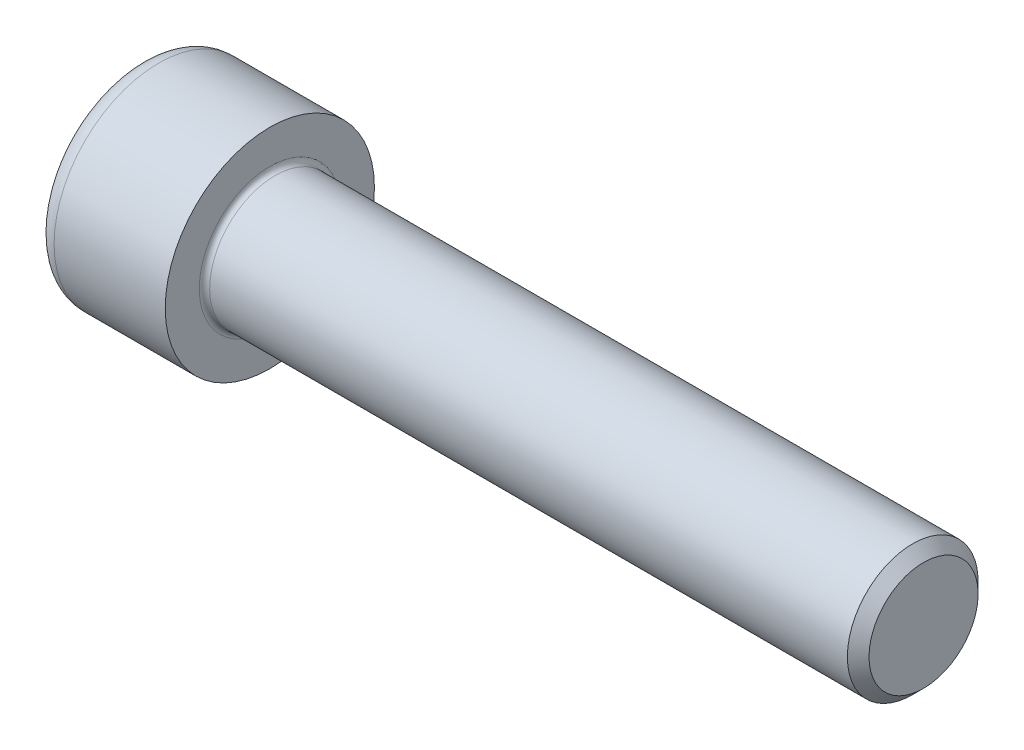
from build123d import *

# Parameters (mm, degrees)
FILLET1_R   = 0.4
FILLET2_R   = 1.5
HEX_2_DEPTH = 5


with BuildPart() as part:
    # BodySke → Base-Revolve (revolve)
    with BuildSketch(Plane.XY, mode=Mode.PRIVATE) as base_revolve_sk:
        Polygon((0, 0), (0, 8), (10, 8), (10, 5), (59.172, 5), (60, 4.172), (60, 0), align=None)
    revolve(base_revolve_sk.sketch.rotate(Axis((-31.75, 0, 0), (1, 0, 0)), 90), axis=Axis((-31.75, 0, 0), (1, 0, 0)))

    # Fillet1
    fillet1_edges = [part.edges().sort_by_distance(p)[0] for p in [
        (10, 0, -5),
    ]]
    fillet(fillet1_edges, radius=FILLET1_R)

    # Fillet2
    fillet2_edges = [part.edges().sort_by_distance(p)[0] for p in [
        (0, 0, -8),
    ]]
    fillet(fillet2_edges, radius=FILLET2_R)

    # Sketch2 → Hex-PreBroach (revolve, cut)
    with BuildSketch(Plane.XY, mode=Mode.PRIVATE) as hex_prebroach_sk:
        Polygon((0, 4.0575), (5, 4.0575), (7.342598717, 0), (0, 0), align=None)
    revolve(hex_prebroach_sk.sketch.rotate(Axis((0, 0, 0), (1, 0, 0)), 90), axis=Axis((0, 0, 0), (1, 0, 0)), mode=Mode.SUBTRACT)

    # Sketch3 → Hex 2 (cut)
    with BuildSketch(Plane(origin=(0, 0, 0), x_dir=(0, 0.500000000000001, 0.866025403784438), z_dir=(-1, 0, 0))):
        Polygon((2.342598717, 4.0575), (-2.342598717, 4.0575), (-4.685197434, 0), (-2.342598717, -4.0575), (2.342598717, -4.0575), (4.685197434, 0), align=None)
    extrude(amount=-HEX_2_DEPTH, mode=Mode.SUBTRACT)


solid = part.part
